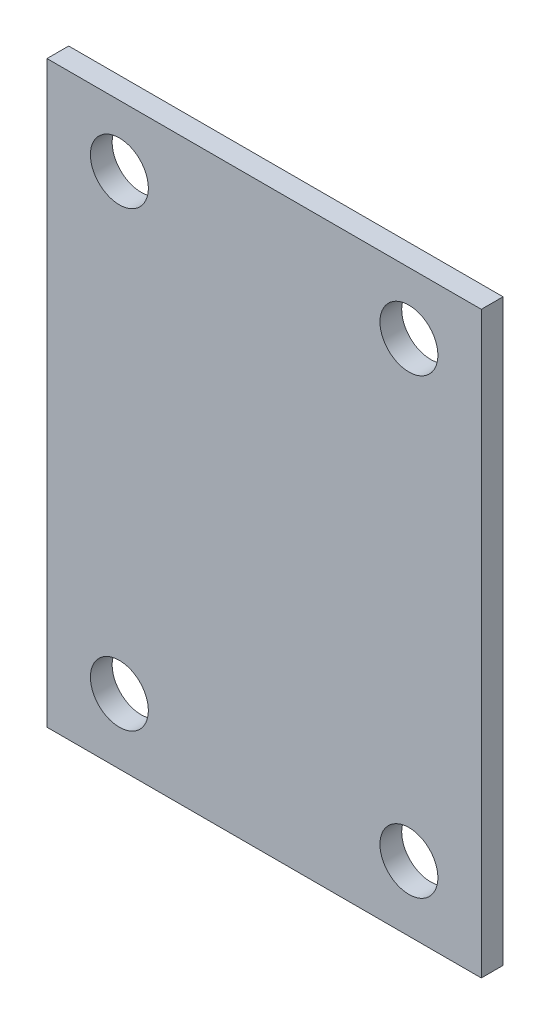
ISO-10303-21;
HEADER;
FILE_DESCRIPTION(('STEP AP214'),'2;1');
FILE_NAME('part.step','',(''),(''),'','','');
FILE_SCHEMA(('AUTOMOTIVE_DESIGN { 1 0 10303 214 1 1 1 1 }'));
ENDSEC;
DATA;
#1=APPLICATION_CONTEXT('core data for automotive mechanical design processes');
#2=APPLICATION_PROTOCOL_DEFINITION('international standard','automotive_design',2000,#1);
#3=PRODUCT_CONTEXT('',#1,'mechanical');
#4=PRODUCT('Part','Part','',(#3));
#5=PRODUCT_RELATED_PRODUCT_CATEGORY('part','',(#4));
#6=PRODUCT_DEFINITION_FORMATION('','',#4);
#7=PRODUCT_DEFINITION_CONTEXT('part definition',#1,'design');
#8=PRODUCT_DEFINITION('design','',#6,#7);
#9=PRODUCT_DEFINITION_SHAPE('','',#8);
#10=(LENGTH_UNIT() NAMED_UNIT(*) SI_UNIT(.MILLI.,.METRE.));
#11=(NAMED_UNIT(*) PLANE_ANGLE_UNIT() SI_UNIT($,.RADIAN.));
#12=(NAMED_UNIT(*) SI_UNIT($,.STERADIAN.) SOLID_ANGLE_UNIT());
#13=UNCERTAINTY_MEASURE_WITH_UNIT(LENGTH_MEASURE(1.E-05),#10,'distance_accuracy_value','');
#14=(GEOMETRIC_REPRESENTATION_CONTEXT(3) GLOBAL_UNCERTAINTY_ASSIGNED_CONTEXT((#13)) GLOBAL_UNIT_ASSIGNED_CONTEXT((#10,
#11,#12)) REPRESENTATION_CONTEXT('',''));
#15=CARTESIAN_POINT('',(0.,0.,0.));
#16=DIRECTION('',(0.,0.,1.));
#17=DIRECTION('',(1.,0.,0.));
#18=AXIS2_PLACEMENT_3D('',#15,#16,#17);
#19=CARTESIAN_POINT('',(0.,0.,-28.));
#20=DIRECTION('',(0.,-1.,0.));
#21=DIRECTION('',(0.,0.,-1.));
#22=AXIS2_PLACEMENT_3D('',#19,#20,#21);
#23=CYLINDRICAL_SURFACE('',#22,8.);
#24=CARTESIAN_POINT('',(0.,16.,-28.));
#25=DIRECTION('',(0.,-1.,0.));
#26=DIRECTION('',(0.,0.,-1.));
#27=AXIS2_PLACEMENT_3D('',#24,#25,#26);
#28=CIRCLE('',#27,8.);
#29=CARTESIAN_POINT('',(0.,16.,-36.));
#30=VERTEX_POINT('',#29);
#31=EDGE_CURVE('E127',#30,#30,#28,.F.);
#32=ORIENTED_EDGE('',*,*,#31,.T.);
#33=EDGE_LOOP('',(#32));
#34=FACE_BOUND('',#33,.T.);
#35=CARTESIAN_POINT('',(0.,0.,-28.));
#36=DIRECTION('',(0.,-1.,0.));
#37=DIRECTION('',(0.,0.,-1.));
#38=AXIS2_PLACEMENT_3D('',#35,#36,#37);
#39=CIRCLE('',#38,8.);
#40=CARTESIAN_POINT('',(0.,0.,-36.));
#41=VERTEX_POINT('',#40);
#42=EDGE_CURVE('E19',#41,#41,#39,.F.);
#43=ORIENTED_EDGE('',*,*,#42,.F.);
#44=EDGE_LOOP('',(#43));
#45=FACE_BOUND('',#44,.T.);
#46=ADVANCED_FACE('F16',(#34,#45),#23,.F.);
#47=CARTESIAN_POINT('',(-20.,0.,-40.));
#48=DIRECTION('',(0.,0.,-1.));
#49=DIRECTION('',(-1.,0.,0.));
#50=AXIS2_PLACEMENT_3D('',#47,#48,#49);
#51=PLANE('',#50);
#52=DIRECTION('',(0.,1.,0.));
#53=VECTOR('',#52,1.);
#54=CARTESIAN_POINT('',(20.,0.,-40.));
#55=LINE('',#54,#53);
#56=CARTESIAN_POINT('',(20.,0.,-40.));
#57=VERTEX_POINT('',#56);
#58=CARTESIAN_POINT('',(20.,16.,-40.));
#59=VERTEX_POINT('',#58);
#60=EDGE_CURVE('E85',#57,#59,#55,.T.);
#61=ORIENTED_EDGE('',*,*,#60,.F.);
#62=DIRECTION('',(1.,0.,0.));
#63=VECTOR('',#62,1.);
#64=CARTESIAN_POINT('',(0.,0.,-40.));
#65=LINE('',#64,#63);
#66=CARTESIAN_POINT('',(-20.,0.,-40.));
#67=VERTEX_POINT('',#66);
#68=EDGE_CURVE('E81',#67,#57,#65,.T.);
#69=ORIENTED_EDGE('',*,*,#68,.F.);
#70=DIRECTION('',(0.,1.,0.));
#71=VECTOR('',#70,1.);
#72=CARTESIAN_POINT('',(-20.,0.,-40.));
#73=LINE('',#72,#71);
#74=CARTESIAN_POINT('',(-20.,16.,-40.));
#75=VERTEX_POINT('',#74);
#76=EDGE_CURVE('E78',#75,#67,#73,.F.);
#77=ORIENTED_EDGE('',*,*,#76,.F.);
#78=DIRECTION('',(1.,0.,0.));
#79=VECTOR('',#78,1.);
#80=CARTESIAN_POINT('',(0.,16.,-40.));
#81=LINE('',#80,#79);
#82=EDGE_CURVE('E130',#75,#59,#81,.T.);
#83=ORIENTED_EDGE('',*,*,#82,.T.);
#84=EDGE_LOOP('',(#61,#69,#77,#83));
#85=FACE_BOUND('',#84,.T.);
#86=ADVANCED_FACE('F83',(#85),#51,.T.);
#87=CARTESIAN_POINT('',(0.,0.,0.));
#88=DIRECTION('',(0.,-1.,0.));
#89=DIRECTION('',(0.,0.,-1.));
#90=AXIS2_PLACEMENT_3D('',#87,#88,#89);
#91=PLANE('',#90);
#92=ORIENTED_EDGE('',*,*,#42,.T.);
#93=EDGE_LOOP('',(#92));
#94=FACE_BOUND('',#93,.T.);
#95=ORIENTED_EDGE('',*,*,#68,.T.);
#96=DIRECTION('',(0.,0.,-1.));
#97=VECTOR('',#96,1.);
#98=CARTESIAN_POINT('',(20.,0.,-40.));
#99=LINE('',#98,#97);
#100=CARTESIAN_POINT('',(20.,0.,0.));
#101=VERTEX_POINT('',#100);
#102=EDGE_CURVE('E129',#101,#57,#99,.T.);
#103=ORIENTED_EDGE('',*,*,#102,.F.);
#104=DIRECTION('',(1.,0.,0.));
#105=VECTOR('',#104,1.);
#106=CARTESIAN_POINT('',(0.,0.,0.));
#107=LINE('',#106,#105);
#108=CARTESIAN_POINT('',(-20.,0.,0.));
#109=VERTEX_POINT('',#108);
#110=EDGE_CURVE('E93',#101,#109,#107,.F.);
#111=ORIENTED_EDGE('',*,*,#110,.T.);
#112=DIRECTION('',(0.,0.,1.));
#113=VECTOR('',#112,1.);
#114=CARTESIAN_POINT('',(-20.,0.,0.));
#115=LINE('',#114,#113);
#116=EDGE_CURVE('E90',#67,#109,#115,.T.);
#117=ORIENTED_EDGE('',*,*,#116,.F.);
#118=EDGE_LOOP('',(#95,#103,#111,#117));
#119=FACE_BOUND('',#118,.T.);
#120=ADVANCED_FACE('F91',(#94,#119),#91,.T.);
#121=CARTESIAN_POINT('',(-20.,0.,0.));
#122=DIRECTION('',(-1.,0.,0.));
#123=DIRECTION('',(0.,0.,1.));
#124=AXIS2_PLACEMENT_3D('',#121,#122,#123);
#125=PLANE('',#124);
#126=ORIENTED_EDGE('',*,*,#116,.T.);
#127=DIRECTION('',(0.,1.,0.));
#128=VECTOR('',#127,1.);
#129=CARTESIAN_POINT('',(-20.,0.,0.));
#130=LINE('',#129,#128);
#131=CARTESIAN_POINT('',(-20.,16.,0.));
#132=VERTEX_POINT('',#131);
#133=EDGE_CURVE('E142',#109,#132,#130,.T.);
#134=ORIENTED_EDGE('',*,*,#133,.T.);
#135=DIRECTION('',(0.,0.,-1.));
#136=VECTOR('',#135,1.);
#137=CARTESIAN_POINT('',(-20.,16.,0.));
#138=LINE('',#137,#136);
#139=EDGE_CURVE('E96',#132,#75,#138,.T.);
#140=ORIENTED_EDGE('',*,*,#139,.T.);
#141=ORIENTED_EDGE('',*,*,#76,.T.);
#142=EDGE_LOOP('',(#126,#134,#140,#141));
#143=FACE_BOUND('',#142,.T.);
#144=ADVANCED_FACE('F98',(#143),#125,.T.);
#145=CARTESIAN_POINT('',(0.,16.,0.));
#146=DIRECTION('',(0.,-1.,0.));
#147=DIRECTION('',(0.,0.,-1.));
#148=AXIS2_PLACEMENT_3D('',#145,#146,#147);
#149=PLANE('',#148);
#150=ORIENTED_EDGE('',*,*,#31,.F.);
#151=EDGE_LOOP('',(#150));
#152=FACE_BOUND('',#151,.T.);
#153=DIRECTION('',(0.,0.,-1.));
#154=VECTOR('',#153,1.);
#155=CARTESIAN_POINT('',(20.,16.,-40.));
#156=LINE('',#155,#154);
#157=CARTESIAN_POINT('',(20.,16.,0.));
#158=VERTEX_POINT('',#157);
#159=EDGE_CURVE('E138',#59,#158,#156,.F.);
#160=ORIENTED_EDGE('',*,*,#159,.F.);
#161=ORIENTED_EDGE('',*,*,#82,.F.);
#162=ORIENTED_EDGE('',*,*,#139,.F.);
#163=DIRECTION('',(1.,0.,0.));
#164=VECTOR('',#163,1.);
#165=CARTESIAN_POINT('',(0.,16.,0.));
#166=LINE('',#165,#164);
#167=EDGE_CURVE('E144',#132,#158,#166,.T.);
#168=ORIENTED_EDGE('',*,*,#167,.T.);
#169=EDGE_LOOP('',(#160,#161,#162,#168));
#170=FACE_BOUND('',#169,.T.);
#171=ADVANCED_FACE('F237',(#152,#170),#149,.F.);
#172=CARTESIAN_POINT('',(20.,0.,-40.));
#173=DIRECTION('',(1.,0.,0.));
#174=DIRECTION('',(0.,0.,-1.));
#175=AXIS2_PLACEMENT_3D('',#172,#173,#174);
#176=PLANE('',#175);
#177=ORIENTED_EDGE('',*,*,#159,.T.);
#178=DIRECTION('',(0.,1.,0.));
#179=VECTOR('',#178,1.);
#180=CARTESIAN_POINT('',(20.,0.,0.));
#181=LINE('',#180,#179);
#182=EDGE_CURVE('E146',#158,#101,#181,.F.);
#183=ORIENTED_EDGE('',*,*,#182,.T.);
#184=ORIENTED_EDGE('',*,*,#102,.T.);
#185=ORIENTED_EDGE('',*,*,#60,.T.);
#186=EDGE_LOOP('',(#177,#183,#184,#185));
#187=FACE_BOUND('',#186,.T.);
#188=ADVANCED_FACE('F230',(#187),#176,.T.);
#189=CARTESIAN_POINT('',(0.,0.,0.));
#190=DIRECTION('',(0.,0.,1.));
#191=DIRECTION('',(1.,0.,0.));
#192=AXIS2_PLACEMENT_3D('',#189,#190,#191);
#193=PLANE('',#192);
#194=CARTESIAN_POINT('',(40.,103.,0.));
#195=DIRECTION('',(0.,0.,-1.));
#196=DIRECTION('',(-1.,0.,0.));
#197=AXIS2_PLACEMENT_3D('',#194,#195,#196);
#198=CIRCLE('',#197,8.);
#199=CARTESIAN_POINT('',(32.,103.,0.));
#200=VERTEX_POINT('',#199);
#201=EDGE_CURVE('E114',#200,#200,#198,.F.);
#202=ORIENTED_EDGE('',*,*,#201,.T.);
#203=EDGE_LOOP('',(#202));
#204=FACE_BOUND('',#203,.T.);
#205=CARTESIAN_POINT('',(-40.,103.,0.));
#206=DIRECTION('',(0.,0.,-1.));
#207=DIRECTION('',(-1.,0.,0.));
#208=AXIS2_PLACEMENT_3D('',#205,#206,#207);
#209=CIRCLE('',#208,8.);
#210=CARTESIAN_POINT('',(-48.,103.,0.));
#211=VERTEX_POINT('',#210);
#212=EDGE_CURVE('E118',#211,#211,#209,.F.);
#213=ORIENTED_EDGE('',*,*,#212,.T.);
#214=EDGE_LOOP('',(#213));
#215=FACE_BOUND('',#214,.T.);
#216=CARTESIAN_POINT('',(40.,-22.,0.));
#217=DIRECTION('',(0.,0.,-1.));
#218=DIRECTION('',(-1.,0.,0.));
#219=AXIS2_PLACEMENT_3D('',#216,#217,#218);
#220=CIRCLE('',#219,8.);
#221=CARTESIAN_POINT('',(32.,-22.,0.));
#222=VERTEX_POINT('',#221);
#223=EDGE_CURVE('E121',#222,#222,#220,.F.);
#224=ORIENTED_EDGE('',*,*,#223,.T.);
#225=EDGE_LOOP('',(#224));
#226=FACE_BOUND('',#225,.T.);
#227=CARTESIAN_POINT('',(-40.,-22.,0.));
#228=DIRECTION('',(0.,0.,-1.));
#229=DIRECTION('',(-1.,0.,0.));
#230=AXIS2_PLACEMENT_3D('',#227,#228,#229);
#231=CIRCLE('',#230,8.);
#232=CARTESIAN_POINT('',(-48.,-22.,0.));
#233=VERTEX_POINT('',#232);
#234=EDGE_CURVE('E124',#233,#233,#231,.F.);
#235=ORIENTED_EDGE('',*,*,#234,.T.);
#236=EDGE_LOOP('',(#235));
#237=FACE_BOUND('',#236,.T.);
#238=ORIENTED_EDGE('',*,*,#167,.F.);
#239=ORIENTED_EDGE('',*,*,#133,.F.);
#240=ORIENTED_EDGE('',*,*,#110,.F.);
#241=ORIENTED_EDGE('',*,*,#182,.F.);
#242=EDGE_LOOP('',(#238,#239,#240,#241));
#243=FACE_BOUND('',#242,.T.);
#244=DIRECTION('',(0.,1.,0.));
#245=VECTOR('',#244,1.);
#246=CARTESIAN_POINT('',(60.,-40.,0.));
#247=LINE('',#246,#245);
#248=CARTESIAN_POINT('',(60.,-40.,0.));
#249=VERTEX_POINT('',#248);
#250=CARTESIAN_POINT('',(60.,120.,0.));
#251=VERTEX_POINT('',#250);
#252=EDGE_CURVE('E154',#249,#251,#247,.T.);
#253=ORIENTED_EDGE('',*,*,#252,.F.);
#254=DIRECTION('',(1.,0.,0.));
#255=VECTOR('',#254,1.);
#256=CARTESIAN_POINT('',(-60.,-40.,0.));
#257=LINE('',#256,#255);
#258=CARTESIAN_POINT('',(-60.,-40.,0.));
#259=VERTEX_POINT('',#258);
#260=EDGE_CURVE('E149',#259,#249,#257,.T.);
#261=ORIENTED_EDGE('',*,*,#260,.F.);
#262=DIRECTION('',(0.,1.,0.));
#263=VECTOR('',#262,1.);
#264=CARTESIAN_POINT('',(-60.,120.,0.));
#265=LINE('',#264,#263);
#266=CARTESIAN_POINT('',(-60.,120.,0.));
#267=VERTEX_POINT('',#266);
#268=EDGE_CURVE('E126',#267,#259,#265,.F.);
#269=ORIENTED_EDGE('',*,*,#268,.F.);
#270=DIRECTION('',(1.,0.,0.));
#271=VECTOR('',#270,1.);
#272=CARTESIAN_POINT('',(60.,120.,0.));
#273=LINE('',#272,#271);
#274=EDGE_CURVE('E159',#251,#267,#273,.F.);
#275=ORIENTED_EDGE('',*,*,#274,.F.);
#276=EDGE_LOOP('',(#253,#261,#269,#275));
#277=FACE_BOUND('',#276,.T.);
#278=ADVANCED_FACE('F227',(#204,#215,#226,#237,#243,#277),#193,.F.);
#279=CARTESIAN_POINT('',(-60.,-40.,0.));
#280=DIRECTION('',(0.,-1.,0.));
#281=DIRECTION('',(0.,0.,-1.));
#282=AXIS2_PLACEMENT_3D('',#279,#280,#281);
#283=PLANE('',#282);
#284=DIRECTION('',(0.,0.,1.));
#285=VECTOR('',#284,1.);
#286=CARTESIAN_POINT('',(-60.,-40.,0.));
#287=LINE('',#286,#285);
#288=CARTESIAN_POINT('',(-60.,-40.,6.));
#289=VERTEX_POINT('',#288);
#290=EDGE_CURVE('E161',#259,#289,#287,.T.);
#291=ORIENTED_EDGE('',*,*,#290,.F.);
#292=ORIENTED_EDGE('',*,*,#260,.T.);
#293=DIRECTION('',(0.,0.,-1.));
#294=VECTOR('',#293,1.);
#295=CARTESIAN_POINT('',(60.,-40.,0.));
#296=LINE('',#295,#294);
#297=CARTESIAN_POINT('',(60.,-40.,6.));
#298=VERTEX_POINT('',#297);
#299=EDGE_CURVE('E151',#298,#249,#296,.T.);
#300=ORIENTED_EDGE('',*,*,#299,.F.);
#301=DIRECTION('',(1.,0.,0.));
#302=VECTOR('',#301,1.);
#303=CARTESIAN_POINT('',(0.,-40.,6.));
#304=LINE('',#303,#302);
#305=EDGE_CURVE('E117',#289,#298,#304,.T.);
#306=ORIENTED_EDGE('',*,*,#305,.F.);
#307=EDGE_LOOP('',(#291,#292,#300,#306));
#308=FACE_BOUND('',#307,.T.);
#309=ADVANCED_FACE('F183',(#308),#283,.T.);
#310=CARTESIAN_POINT('',(60.,-40.,0.));
#311=DIRECTION('',(1.,0.,0.));
#312=DIRECTION('',(0.,0.,-1.));
#313=AXIS2_PLACEMENT_3D('',#310,#311,#312);
#314=PLANE('',#313);
#315=ORIENTED_EDGE('',*,*,#299,.T.);
#316=ORIENTED_EDGE('',*,*,#252,.T.);
#317=DIRECTION('',(0.,0.,1.));
#318=VECTOR('',#317,1.);
#319=CARTESIAN_POINT('',(60.,120.,0.));
#320=LINE('',#319,#318);
#321=CARTESIAN_POINT('',(60.,120.,6.));
#322=VERTEX_POINT('',#321);
#323=EDGE_CURVE('E156',#322,#251,#320,.F.);
#324=ORIENTED_EDGE('',*,*,#323,.F.);
#325=DIRECTION('',(0.,1.,0.));
#326=VECTOR('',#325,1.);
#327=CARTESIAN_POINT('',(60.,0.,6.));
#328=LINE('',#327,#326);
#329=EDGE_CURVE('E169',#298,#322,#328,.T.);
#330=ORIENTED_EDGE('',*,*,#329,.F.);
#331=EDGE_LOOP('',(#315,#316,#324,#330));
#332=FACE_BOUND('',#331,.T.);
#333=ADVANCED_FACE('F187',(#332),#314,.T.);
#334=CARTESIAN_POINT('',(60.,120.,0.));
#335=DIRECTION('',(0.,1.,0.));
#336=DIRECTION('',(0.,0.,1.));
#337=AXIS2_PLACEMENT_3D('',#334,#335,#336);
#338=PLANE('',#337);
#339=ORIENTED_EDGE('',*,*,#323,.T.);
#340=ORIENTED_EDGE('',*,*,#274,.T.);
#341=DIRECTION('',(0.,0.,1.));
#342=VECTOR('',#341,1.);
#343=CARTESIAN_POINT('',(-60.,120.,0.));
#344=LINE('',#343,#342);
#345=CARTESIAN_POINT('',(-60.,120.,6.));
#346=VERTEX_POINT('',#345);
#347=EDGE_CURVE('E34',#346,#267,#344,.F.);
#348=ORIENTED_EDGE('',*,*,#347,.F.);
#349=DIRECTION('',(1.,0.,0.));
#350=VECTOR('',#349,1.);
#351=CARTESIAN_POINT('',(0.,120.,6.));
#352=LINE('',#351,#350);
#353=EDGE_CURVE('E172',#322,#346,#352,.F.);
#354=ORIENTED_EDGE('',*,*,#353,.F.);
#355=EDGE_LOOP('',(#339,#340,#348,#354));
#356=FACE_BOUND('',#355,.T.);
#357=ADVANCED_FACE('F189',(#356),#338,.T.);
#358=CARTESIAN_POINT('',(-60.,120.,0.));
#359=DIRECTION('',(-1.,0.,0.));
#360=DIRECTION('',(0.,0.,1.));
#361=AXIS2_PLACEMENT_3D('',#358,#359,#360);
#362=PLANE('',#361);
#363=ORIENTED_EDGE('',*,*,#347,.T.);
#364=ORIENTED_EDGE('',*,*,#268,.T.);
#365=ORIENTED_EDGE('',*,*,#290,.T.);
#366=DIRECTION('',(0.,1.,0.));
#367=VECTOR('',#366,1.);
#368=CARTESIAN_POINT('',(-60.,0.,6.));
#369=LINE('',#368,#367);
#370=EDGE_CURVE('E113',#346,#289,#369,.F.);
#371=ORIENTED_EDGE('',*,*,#370,.F.);
#372=EDGE_LOOP('',(#363,#364,#365,#371));
#373=FACE_BOUND('',#372,.T.);
#374=ADVANCED_FACE('F179',(#373),#362,.T.);
#375=CARTESIAN_POINT('',(-40.,-22.,0.));
#376=DIRECTION('',(0.,0.,-1.));
#377=DIRECTION('',(-1.,0.,0.));
#378=AXIS2_PLACEMENT_3D('',#375,#376,#377);
#379=CYLINDRICAL_SURFACE('',#378,8.);
#380=CARTESIAN_POINT('',(-40.,-22.,6.));
#381=DIRECTION('',(0.,0.,-1.));
#382=DIRECTION('',(-1.,0.,0.));
#383=AXIS2_PLACEMENT_3D('',#380,#381,#382);
#384=CIRCLE('',#383,8.);
#385=CARTESIAN_POINT('',(-48.,-22.,6.));
#386=VERTEX_POINT('',#385);
#387=EDGE_CURVE('E110',#386,#386,#384,.T.);
#388=ORIENTED_EDGE('',*,*,#387,.F.);
#389=EDGE_LOOP('',(#388));
#390=FACE_BOUND('',#389,.T.);
#391=ORIENTED_EDGE('',*,*,#234,.F.);
#392=EDGE_LOOP('',(#391));
#393=FACE_BOUND('',#392,.T.);
#394=ADVANCED_FACE('F197',(#390,#393),#379,.F.);
#395=CARTESIAN_POINT('',(40.,-22.,0.));
#396=DIRECTION('',(0.,0.,-1.));
#397=DIRECTION('',(-1.,0.,0.));
#398=AXIS2_PLACEMENT_3D('',#395,#396,#397);
#399=CYLINDRICAL_SURFACE('',#398,8.);
#400=CARTESIAN_POINT('',(40.,-22.,6.));
#401=DIRECTION('',(0.,0.,-1.));
#402=DIRECTION('',(-1.,0.,0.));
#403=AXIS2_PLACEMENT_3D('',#400,#401,#402);
#404=CIRCLE('',#403,8.);
#405=CARTESIAN_POINT('',(32.,-22.,6.));
#406=VERTEX_POINT('',#405);
#407=EDGE_CURVE('E107',#406,#406,#404,.T.);
#408=ORIENTED_EDGE('',*,*,#407,.F.);
#409=EDGE_LOOP('',(#408));
#410=FACE_BOUND('',#409,.T.);
#411=ORIENTED_EDGE('',*,*,#223,.F.);
#412=EDGE_LOOP('',(#411));
#413=FACE_BOUND('',#412,.T.);
#414=ADVANCED_FACE('F214',(#410,#413),#399,.F.);
#415=CARTESIAN_POINT('',(-40.,103.,0.));
#416=DIRECTION('',(0.,0.,-1.));
#417=DIRECTION('',(-1.,0.,0.));
#418=AXIS2_PLACEMENT_3D('',#415,#416,#417);
#419=CYLINDRICAL_SURFACE('',#418,8.);
#420=CARTESIAN_POINT('',(-40.,103.,6.));
#421=DIRECTION('',(0.,0.,-1.));
#422=DIRECTION('',(-1.,0.,0.));
#423=AXIS2_PLACEMENT_3D('',#420,#421,#422);
#424=CIRCLE('',#423,8.);
#425=CARTESIAN_POINT('',(-48.,103.,6.));
#426=VERTEX_POINT('',#425);
#427=EDGE_CURVE('E25',#426,#426,#424,.T.);
#428=ORIENTED_EDGE('',*,*,#427,.F.);
#429=EDGE_LOOP('',(#428));
#430=FACE_BOUND('',#429,.T.);
#431=ORIENTED_EDGE('',*,*,#212,.F.);
#432=EDGE_LOOP('',(#431));
#433=FACE_BOUND('',#432,.T.);
#434=ADVANCED_FACE('F207',(#430,#433),#419,.F.);
#435=CARTESIAN_POINT('',(40.,103.,0.));
#436=DIRECTION('',(0.,0.,-1.));
#437=DIRECTION('',(-1.,0.,0.));
#438=AXIS2_PLACEMENT_3D('',#435,#436,#437);
#439=CYLINDRICAL_SURFACE('',#438,8.);
#440=CARTESIAN_POINT('',(40.,103.,6.));
#441=DIRECTION('',(0.,0.,-1.));
#442=DIRECTION('',(-1.,0.,0.));
#443=AXIS2_PLACEMENT_3D('',#440,#441,#442);
#444=CIRCLE('',#443,8.);
#445=CARTESIAN_POINT('',(32.,103.,6.));
#446=VERTEX_POINT('',#445);
#447=EDGE_CURVE('E10',#446,#446,#444,.T.);
#448=ORIENTED_EDGE('',*,*,#447,.F.);
#449=EDGE_LOOP('',(#448));
#450=FACE_BOUND('',#449,.T.);
#451=ORIENTED_EDGE('',*,*,#201,.F.);
#452=EDGE_LOOP('',(#451));
#453=FACE_BOUND('',#452,.T.);
#454=ADVANCED_FACE('F201',(#450,#453),#439,.F.);
#455=CARTESIAN_POINT('',(0.,0.,6.));
#456=DIRECTION('',(0.,0.,1.));
#457=DIRECTION('',(1.,0.,0.));
#458=AXIS2_PLACEMENT_3D('',#455,#456,#457);
#459=PLANE('',#458);
#460=ORIENTED_EDGE('',*,*,#447,.T.);
#461=EDGE_LOOP('',(#460));
#462=FACE_BOUND('',#461,.T.);
#463=ORIENTED_EDGE('',*,*,#427,.T.);
#464=EDGE_LOOP('',(#463));
#465=FACE_BOUND('',#464,.T.);
#466=ORIENTED_EDGE('',*,*,#407,.T.);
#467=EDGE_LOOP('',(#466));
#468=FACE_BOUND('',#467,.T.);
#469=ORIENTED_EDGE('',*,*,#387,.T.);
#470=EDGE_LOOP('',(#469));
#471=FACE_BOUND('',#470,.T.);
#472=ORIENTED_EDGE('',*,*,#353,.T.);
#473=ORIENTED_EDGE('',*,*,#370,.T.);
#474=ORIENTED_EDGE('',*,*,#305,.T.);
#475=ORIENTED_EDGE('',*,*,#329,.T.);
#476=EDGE_LOOP('',(#472,#473,#474,#475));
#477=FACE_BOUND('',#476,.T.);
#478=ADVANCED_FACE('F177',(#462,#465,#468,#471,#477),#459,.T.);
#479=CLOSED_SHELL('',(#46,#86,#120,#144,#171,#188,#278,#309,#333,#357,#374,#394,#414,#434,#454,#478));
#480=MANIFOLD_SOLID_BREP('B1',#479);
#481=ADVANCED_BREP_SHAPE_REPRESENTATION('',(#18,#480),#14);
#482=SHAPE_DEFINITION_REPRESENTATION(#9,#481);
ENDSEC;
END-ISO-10303-21;
